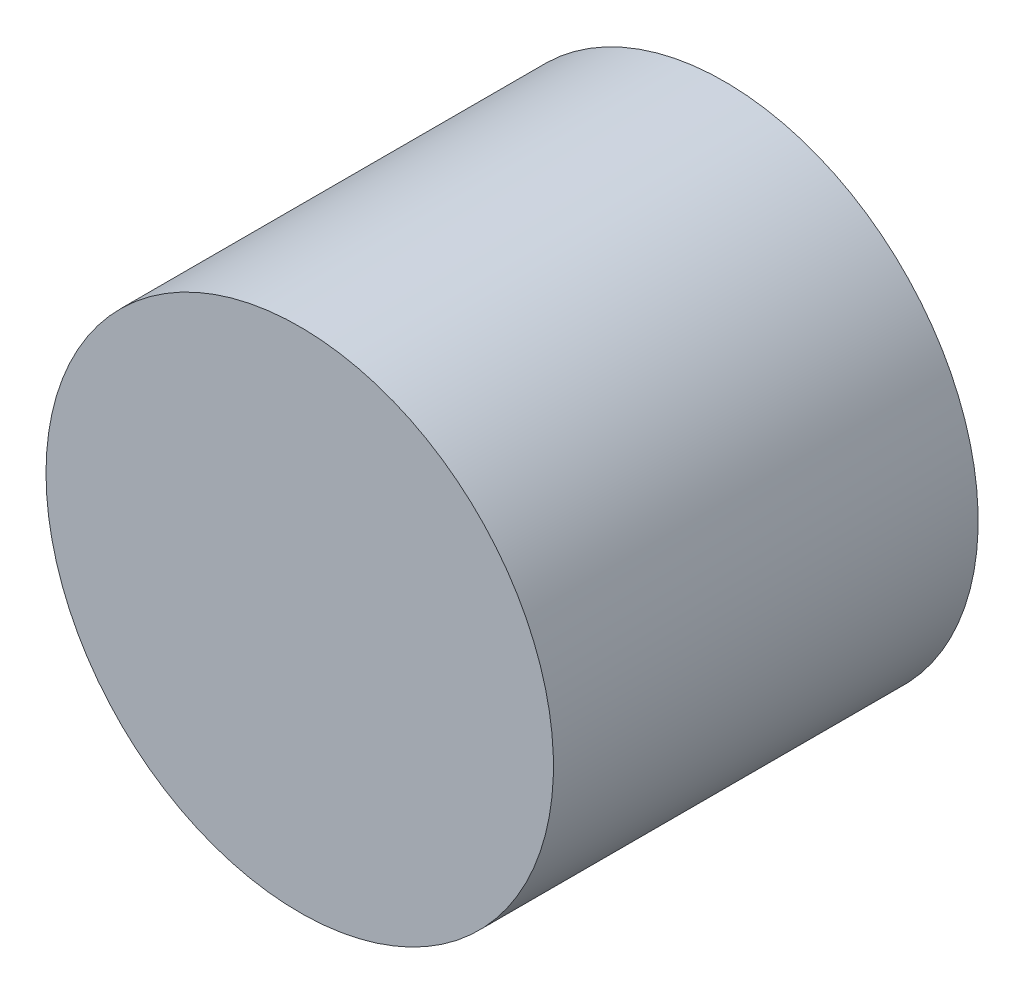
ISO-10303-21;
HEADER;
FILE_DESCRIPTION(('STEP AP214'),'2;1');
FILE_NAME('part.step','',(''),(''),'','','');
FILE_SCHEMA(('AUTOMOTIVE_DESIGN { 1 0 10303 214 1 1 1 1 }'));
ENDSEC;
DATA;
#1=APPLICATION_CONTEXT('core data for automotive mechanical design processes');
#2=APPLICATION_PROTOCOL_DEFINITION('international standard','automotive_design',2000,#1);
#3=PRODUCT_CONTEXT('',#1,'mechanical');
#4=PRODUCT('Part','Part','',(#3));
#5=PRODUCT_RELATED_PRODUCT_CATEGORY('part','',(#4));
#6=PRODUCT_DEFINITION_FORMATION('','',#4);
#7=PRODUCT_DEFINITION_CONTEXT('part definition',#1,'design');
#8=PRODUCT_DEFINITION('design','',#6,#7);
#9=PRODUCT_DEFINITION_SHAPE('','',#8);
#10=(LENGTH_UNIT() NAMED_UNIT(*) SI_UNIT(.MILLI.,.METRE.));
#11=(NAMED_UNIT(*) PLANE_ANGLE_UNIT() SI_UNIT($,.RADIAN.));
#12=(NAMED_UNIT(*) SI_UNIT($,.STERADIAN.) SOLID_ANGLE_UNIT());
#13=UNCERTAINTY_MEASURE_WITH_UNIT(LENGTH_MEASURE(1.E-05),#10,'distance_accuracy_value','');
#14=(GEOMETRIC_REPRESENTATION_CONTEXT(3) GLOBAL_UNCERTAINTY_ASSIGNED_CONTEXT((#13)) GLOBAL_UNIT_ASSIGNED_CONTEXT((#10,
#11,#12)) REPRESENTATION_CONTEXT('',''));
#15=CARTESIAN_POINT('',(0.,0.,0.));
#16=DIRECTION('',(0.,0.,1.));
#17=DIRECTION('',(1.,0.,0.));
#18=AXIS2_PLACEMENT_3D('',#15,#16,#17);
#19=CARTESIAN_POINT('',(-0.739379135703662,0.684339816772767,7.69999999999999));
#20=DIRECTION('',(0.,0.,-1.));
#21=DIRECTION('',(-1.,0.,0.));
#22=AXIS2_PLACEMENT_3D('',#19,#20,#21);
#23=CYLINDRICAL_SURFACE('',#22,4.59999999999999);
#24=CARTESIAN_POINT('',(-0.739379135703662,0.684339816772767,7.69999999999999));
#25=DIRECTION('',(0.,0.,1.));
#26=DIRECTION('',(1.,0.,0.));
#27=AXIS2_PLACEMENT_3D('',#24,#25,#26);
#28=CIRCLE('',#27,4.59999999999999);
#29=CARTESIAN_POINT('',(-5.33937913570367,0.684339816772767,7.69999999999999));
#30=VERTEX_POINT('',#29);
#31=EDGE_CURVE('E10',#30,#30,#28,.T.);
#32=CARTESIAN_POINT('',(-0.739379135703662,0.684339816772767,0.));
#33=DIRECTION('',(0.,0.,1.));
#34=DIRECTION('',(1.,0.,0.));
#35=AXIS2_PLACEMENT_3D('',#32,#33,#34);
#36=CIRCLE('',#35,4.59999999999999);
#37=CARTESIAN_POINT('',(-5.33937913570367,0.684339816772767,0.));
#38=VERTEX_POINT('',#37);
#39=EDGE_CURVE('E42',#38,#38,#36,.T.);
#40=CARTESIAN_POINT('',(-5.33937913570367,0.684339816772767,7.69999999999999));
#41=CARTESIAN_POINT('',(-5.33937913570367,0.684339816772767,7.61979166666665));
#42=CARTESIAN_POINT('',(-5.33937913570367,0.684339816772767,7.53958333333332));
#43=CARTESIAN_POINT('',(-5.33937913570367,0.684339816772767,7.37916666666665));
#44=CARTESIAN_POINT('',(-5.33937913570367,0.684339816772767,7.29895833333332));
#45=CARTESIAN_POINT('',(-5.33937913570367,0.684339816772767,7.13854166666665));
#46=CARTESIAN_POINT('',(-5.33937913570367,0.684339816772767,7.05833333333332));
#47=CARTESIAN_POINT('',(-5.33937913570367,0.684339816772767,6.89791666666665));
#48=CARTESIAN_POINT('',(-5.33937913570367,0.684339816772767,6.81770833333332));
#49=CARTESIAN_POINT('',(-5.33937913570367,0.684339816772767,6.65729166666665));
#50=CARTESIAN_POINT('',(-5.33937913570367,0.684339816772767,6.57708333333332));
#51=CARTESIAN_POINT('',(-5.33937913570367,0.684339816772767,6.41666666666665));
#52=CARTESIAN_POINT('',(-5.33937913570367,0.684339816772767,6.33645833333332));
#53=CARTESIAN_POINT('',(-5.33937913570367,0.684339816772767,6.17604166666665));
#54=CARTESIAN_POINT('',(-5.33937913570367,0.684339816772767,6.09583333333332));
#55=CARTESIAN_POINT('',(-5.33937913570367,0.684339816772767,5.93541666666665));
#56=CARTESIAN_POINT('',(-5.33937913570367,0.684339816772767,5.85520833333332));
#57=CARTESIAN_POINT('',(-5.33937913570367,0.684339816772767,5.69479166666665));
#58=CARTESIAN_POINT('',(-5.33937913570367,0.684339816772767,5.61458333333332));
#59=CARTESIAN_POINT('',(-5.33937913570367,0.684339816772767,5.45416666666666));
#60=CARTESIAN_POINT('',(-5.33937913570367,0.684339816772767,5.37395833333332));
#61=CARTESIAN_POINT('',(-5.33937913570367,0.684339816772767,5.21354166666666));
#62=CARTESIAN_POINT('',(-5.33937913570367,0.684339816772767,5.13333333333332));
#63=CARTESIAN_POINT('',(-5.33937913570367,0.684339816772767,4.97291666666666));
#64=CARTESIAN_POINT('',(-5.33937913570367,0.684339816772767,4.89270833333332));
#65=CARTESIAN_POINT('',(-5.33937913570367,0.684339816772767,4.73229166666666));
#66=CARTESIAN_POINT('',(-5.33937913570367,0.684339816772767,4.65208333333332));
#67=CARTESIAN_POINT('',(-5.33937913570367,0.684339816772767,4.49166666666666));
#68=CARTESIAN_POINT('',(-5.33937913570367,0.684339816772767,4.41145833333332));
#69=CARTESIAN_POINT('',(-5.33937913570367,0.684339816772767,4.25104166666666));
#70=CARTESIAN_POINT('',(-5.33937913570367,0.684339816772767,4.17083333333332));
#71=CARTESIAN_POINT('',(-5.33937913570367,0.684339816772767,4.01041666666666));
#72=CARTESIAN_POINT('',(-5.33937913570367,0.684339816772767,3.93020833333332));
#73=CARTESIAN_POINT('',(-5.33937913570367,0.684339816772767,3.76979166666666));
#74=CARTESIAN_POINT('',(-5.33937913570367,0.684339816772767,3.68958333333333));
#75=CARTESIAN_POINT('',(-5.33937913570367,0.684339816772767,3.52916666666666));
#76=CARTESIAN_POINT('',(-5.33937913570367,0.684339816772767,3.44895833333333));
#77=CARTESIAN_POINT('',(-5.33937913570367,0.684339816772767,3.28854166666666));
#78=CARTESIAN_POINT('',(-5.33937913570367,0.684339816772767,3.20833333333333));
#79=CARTESIAN_POINT('',(-5.33937913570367,0.684339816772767,3.04791666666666));
#80=CARTESIAN_POINT('',(-5.33937913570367,0.684339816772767,2.96770833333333));
#81=CARTESIAN_POINT('',(-5.33937913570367,0.684339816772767,2.80729166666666));
#82=CARTESIAN_POINT('',(-5.33937913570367,0.684339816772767,2.72708333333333));
#83=CARTESIAN_POINT('',(-5.33937913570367,0.684339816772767,2.56666666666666));
#84=CARTESIAN_POINT('',(-5.33937913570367,0.684339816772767,2.48645833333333));
#85=CARTESIAN_POINT('',(-5.33937913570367,0.684339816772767,2.32604166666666));
#86=CARTESIAN_POINT('',(-5.33937913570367,0.684339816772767,2.24583333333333));
#87=CARTESIAN_POINT('',(-5.33937913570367,0.684339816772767,2.08541666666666));
#88=CARTESIAN_POINT('',(-5.33937913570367,0.684339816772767,2.00520833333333));
#89=CARTESIAN_POINT('',(-5.33937913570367,0.684339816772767,1.84479166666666));
#90=CARTESIAN_POINT('',(-5.33937913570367,0.684339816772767,1.76458333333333));
#91=CARTESIAN_POINT('',(-5.33937913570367,0.684339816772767,1.60416666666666));
#92=CARTESIAN_POINT('',(-5.33937913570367,0.684339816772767,1.52395833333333));
#93=CARTESIAN_POINT('',(-5.33937913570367,0.684339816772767,1.36354166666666));
#94=CARTESIAN_POINT('',(-5.33937913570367,0.684339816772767,1.28333333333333));
#95=CARTESIAN_POINT('',(-5.33937913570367,0.684339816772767,1.12291666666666));
#96=CARTESIAN_POINT('',(-5.33937913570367,0.684339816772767,1.04270833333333));
#97=CARTESIAN_POINT('',(-5.33937913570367,0.684339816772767,0.882291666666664));
#98=CARTESIAN_POINT('',(-5.33937913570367,0.684339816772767,0.802083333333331));
#99=CARTESIAN_POINT('',(-5.33937913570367,0.684339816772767,0.641666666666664));
#100=CARTESIAN_POINT('',(-5.33937913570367,0.684339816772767,0.561458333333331));
#101=CARTESIAN_POINT('',(-5.33937913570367,0.684339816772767,0.401041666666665));
#102=CARTESIAN_POINT('',(-5.33937913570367,0.684339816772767,0.320833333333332));
#103=CARTESIAN_POINT('',(-5.33937913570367,0.684339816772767,0.160416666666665));
#104=CARTESIAN_POINT('',(-5.33937913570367,0.684339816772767,0.0802083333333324));
#105=CARTESIAN_POINT('',(-5.33937913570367,0.684339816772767,0.));
#106=B_SPLINE_CURVE_WITH_KNOTS('',3,(#40,#41,#42,#43,#44,#45,#46,#47,#48,#49,#50,#51,#52,#53,
#54,#55,#56,#57,#58,#59,#60,#61,#62,#63,#64,#65,#66,#67,#68,#69,#70,#71,#72,#73,#74,#75,#76,#77,
#78,#79,#80,#81,#82,#83,#84,#85,#86,#87,#88,#89,#90,#91,#92,#93,#94,#95,#96,#97,#98,#99,#100,
#101,#102,#103,#104,#105),.UNSPECIFIED.,.F.,.F.,(4,2,2,2,2,2,2,2,2,2,2,2,2,2,2,2,2,2,2,2,2,2,2,
2,2,2,2,2,2,2,2,2,4),(0.,0.240625,0.48125,0.721874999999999,0.962499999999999,1.203125,1.44375,
1.684375,1.925,2.165625,2.40625,2.64687499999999,2.8875,3.12812499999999,3.36874999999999,
3.60937499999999,3.84999999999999,4.09062499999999,4.33124999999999,4.57187499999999,
4.81249999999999,5.05312499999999,5.29374999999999,5.53437499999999,5.77499999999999,
6.01562499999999,6.25624999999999,6.49687499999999,6.73749999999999,6.97812499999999,
7.21874999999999,7.45937499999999,7.69999999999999),.UNSPECIFIED.);
#107=EDGE_CURVE('BSEAM36',#30,#38,#106,.T.);
#108=ORIENTED_EDGE('',*,*,#31,.F.);
#109=ORIENTED_EDGE('',*,*,#39,.T.);
#110=ORIENTED_EDGE('',*,*,#107,.T.);
#111=ORIENTED_EDGE('',*,*,#107,.F.);
#112=EDGE_LOOP('',(#108,#110,#109,#111));
#113=FACE_BOUND('',#112,.T.);
#114=ADVANCED_FACE('F36',(#113),#23,.T.);
#115=CARTESIAN_POINT('',(-0.739379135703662,0.684339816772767,7.69999999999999));
#116=DIRECTION('',(0.,0.,1.));
#117=DIRECTION('',(1.,0.,0.));
#118=AXIS2_PLACEMENT_3D('',#115,#116,#117);
#119=PLANE('',#118);
#120=ORIENTED_EDGE('',*,*,#31,.T.);
#121=EDGE_LOOP('',(#120));
#122=FACE_BOUND('',#121,.T.);
#123=ADVANCED_FACE('F51',(#122),#119,.T.);
#124=CARTESIAN_POINT('',(-0.739379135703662,0.684339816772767,0.));
#125=DIRECTION('',(0.,0.,1.));
#126=DIRECTION('',(1.,0.,0.));
#127=AXIS2_PLACEMENT_3D('',#124,#125,#126);
#128=PLANE('',#127);
#129=ORIENTED_EDGE('',*,*,#39,.F.);
#130=EDGE_LOOP('',(#129));
#131=FACE_BOUND('',#130,.T.);
#132=ADVANCED_FACE('F49',(#131),#128,.F.);
#133=CLOSED_SHELL('',(#114,#123,#132));
#134=MANIFOLD_SOLID_BREP('B2',#133);
#135=ADVANCED_BREP_SHAPE_REPRESENTATION('',(#18,#134),#14);
#136=SHAPE_DEFINITION_REPRESENTATION(#9,#135);
ENDSEC;
END-ISO-10303-21;
